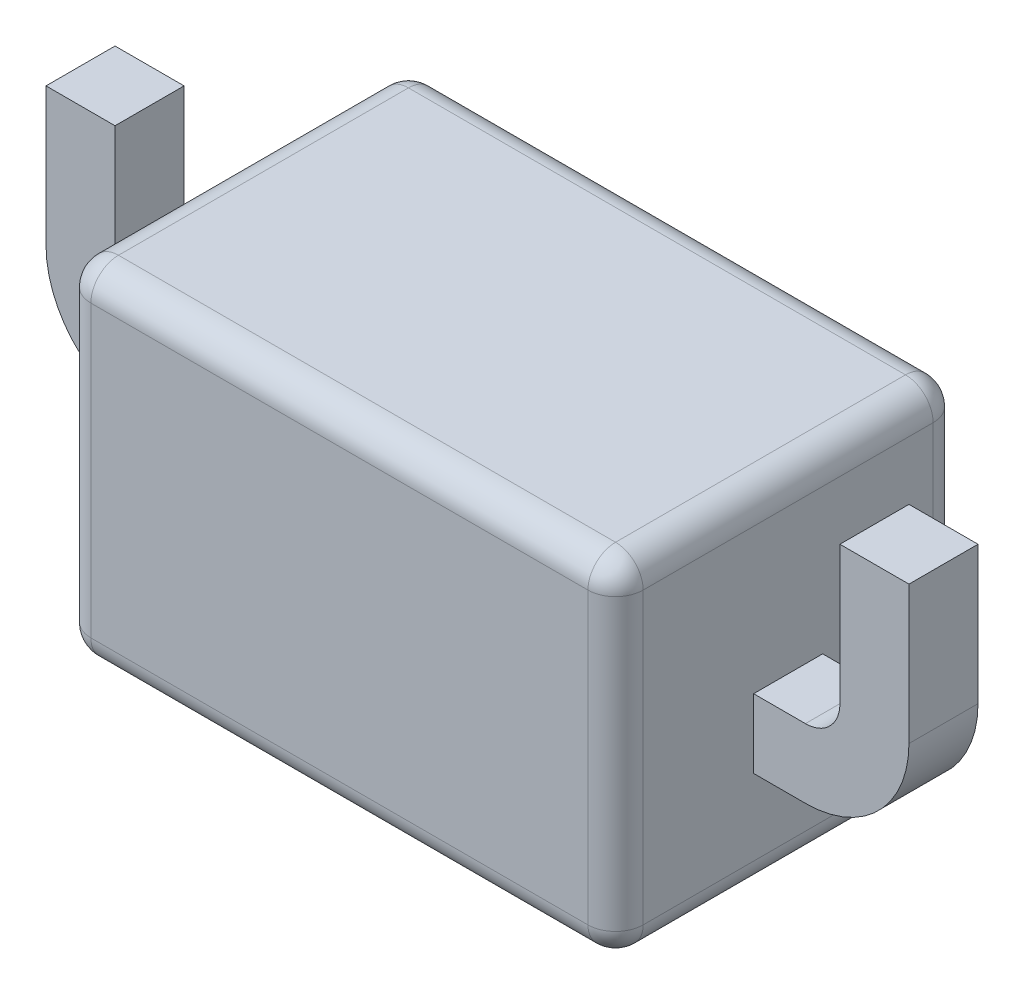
ISO-10303-21;
HEADER;
FILE_DESCRIPTION(('STEP AP214'),'2;1');
FILE_NAME('part.step','',(''),(''),'','','');
FILE_SCHEMA(('AUTOMOTIVE_DESIGN { 1 0 10303 214 1 1 1 1 }'));
ENDSEC;
DATA;
#1=APPLICATION_CONTEXT('core data for automotive mechanical design processes');
#2=APPLICATION_PROTOCOL_DEFINITION('international standard','automotive_design',2000,#1);
#3=PRODUCT_CONTEXT('',#1,'mechanical');
#4=PRODUCT('Part','Part','',(#3));
#5=PRODUCT_RELATED_PRODUCT_CATEGORY('part','',(#4));
#6=PRODUCT_DEFINITION_FORMATION('','',#4);
#7=PRODUCT_DEFINITION_CONTEXT('part definition',#1,'design');
#8=PRODUCT_DEFINITION('design','',#6,#7);
#9=PRODUCT_DEFINITION_SHAPE('','',#8);
#10=(LENGTH_UNIT() NAMED_UNIT(*) SI_UNIT(.MILLI.,.METRE.));
#11=(NAMED_UNIT(*) PLANE_ANGLE_UNIT() SI_UNIT($,.RADIAN.));
#12=(NAMED_UNIT(*) SI_UNIT($,.STERADIAN.) SOLID_ANGLE_UNIT());
#13=UNCERTAINTY_MEASURE_WITH_UNIT(LENGTH_MEASURE(1.E-05),#10,'distance_accuracy_value','');
#14=(GEOMETRIC_REPRESENTATION_CONTEXT(3) GLOBAL_UNCERTAINTY_ASSIGNED_CONTEXT((#13)) GLOBAL_UNIT_ASSIGNED_CONTEXT((#10,
#11,#12)) REPRESENTATION_CONTEXT('',''));
#15=CARTESIAN_POINT('',(0.,0.,0.));
#16=DIRECTION('',(0.,0.,1.));
#17=DIRECTION('',(1.,0.,0.));
#18=AXIS2_PLACEMENT_3D('',#15,#16,#17);
#19=CARTESIAN_POINT('',(1.25,0.,0.1));
#20=DIRECTION('',(0.,0.,1.));
#21=DIRECTION('',(1.,0.,0.));
#22=AXIS2_PLACEMENT_3D('',#19,#20,#21);
#23=PLANE('',#22);
#24=CARTESIAN_POINT('',(0.95,-0.4,0.1));
#25=DIRECTION('',(0.,0.,-1.));
#26=DIRECTION('',(-1.,0.,0.));
#27=AXIS2_PLACEMENT_3D('',#24,#25,#26);
#28=CIRCLE('',#27,0.3);
#29=CARTESIAN_POINT('',(1.25,-0.4,0.1));
#30=VERTEX_POINT('',#29);
#31=CARTESIAN_POINT('',(0.95,-0.7,0.1));
#32=VERTEX_POINT('',#31);
#33=EDGE_CURVE('P0_E21',#30,#32,#28,.T.);
#34=ORIENTED_EDGE('',*,*,#33,.F.);
#35=DIRECTION('',(0.,1.,0.));
#36=VECTOR('',#35,1.);
#37=CARTESIAN_POINT('',(1.25,0.,0.1));
#38=LINE('',#37,#36);
#39=CARTESIAN_POINT('',(1.25,0.,0.1));
#40=VERTEX_POINT('',#39);
#41=EDGE_CURVE('P0_E64',#40,#30,#38,.F.);
#42=ORIENTED_EDGE('',*,*,#41,.F.);
#43=DIRECTION('',(1.,0.,0.));
#44=VECTOR('',#43,1.);
#45=CARTESIAN_POINT('',(1.15,0.,0.1));
#46=LINE('',#45,#44);
#47=CARTESIAN_POINT('',(1.05,0.,0.1));
#48=VERTEX_POINT('',#47);
#49=EDGE_CURVE('P0_E74',#48,#40,#46,.T.);
#50=ORIENTED_EDGE('',*,*,#49,.F.);
#51=DIRECTION('',(0.,1.,0.));
#52=VECTOR('',#51,1.);
#53=CARTESIAN_POINT('',(1.05,0.,0.1));
#54=LINE('',#53,#52);
#55=CARTESIAN_POINT('',(1.05,-0.4,0.1));
#56=VERTEX_POINT('',#55);
#57=EDGE_CURVE('P0_E80',#56,#48,#54,.T.);
#58=ORIENTED_EDGE('',*,*,#57,.F.);
#59=CARTESIAN_POINT('',(0.95,-0.4,0.1));
#60=DIRECTION('',(0.,0.,-1.));
#61=DIRECTION('',(-1.,0.,0.));
#62=AXIS2_PLACEMENT_3D('',#59,#60,#61);
#63=CIRCLE('',#62,0.1);
#64=CARTESIAN_POINT('',(0.95,-0.5,0.1));
#65=VERTEX_POINT('',#64);
#66=EDGE_CURVE('P0_E108',#56,#65,#63,.T.);
#67=ORIENTED_EDGE('',*,*,#66,.T.);
#68=DIRECTION('',(1.,0.,0.));
#69=VECTOR('',#68,1.);
#70=CARTESIAN_POINT('',(0.95,-0.5,0.1));
#71=LINE('',#70,#69);
#72=CARTESIAN_POINT('',(0.8,-0.5,0.1));
#73=VERTEX_POINT('',#72);
#74=EDGE_CURVE('P0_E105',#73,#65,#71,.T.);
#75=ORIENTED_EDGE('',*,*,#74,.F.);
#76=DIRECTION('',(0.,1.,0.));
#77=VECTOR('',#76,1.);
#78=CARTESIAN_POINT('',(0.8,-0.6,0.1));
#79=LINE('',#78,#77);
#80=CARTESIAN_POINT('',(0.8,-0.7,0.1));
#81=VERTEX_POINT('',#80);
#82=EDGE_CURVE('P0_E112',#73,#81,#79,.F.);
#83=ORIENTED_EDGE('',*,*,#82,.T.);
#84=DIRECTION('',(1.,0.,0.));
#85=VECTOR('',#84,1.);
#86=CARTESIAN_POINT('',(0.95,-0.7,0.1));
#87=LINE('',#86,#85);
#88=EDGE_CURVE('P0_E118',#32,#81,#87,.F.);
#89=ORIENTED_EDGE('',*,*,#88,.F.);
#90=EDGE_LOOP('',(#34,#42,#50,#58,#67,#75,#83,#89));
#91=FACE_BOUND('',#90,.T.);
#92=ADVANCED_FACE('P0_F17',(#91),#23,.T.);
#93=CARTESIAN_POINT('',(1.15,0.,0.));
#94=DIRECTION('',(0.,1.,0.));
#95=DIRECTION('',(0.,0.,1.));
#96=AXIS2_PLACEMENT_3D('',#93,#94,#95);
#97=PLANE('',#96);
#98=DIRECTION('',(-1.,0.,0.));
#99=VECTOR('',#98,1.);
#100=CARTESIAN_POINT('',(1.05,0.,-0.1));
#101=LINE('',#100,#99);
#102=CARTESIAN_POINT('',(1.05,0.,-0.1));
#103=VERTEX_POINT('',#102);
#104=CARTESIAN_POINT('',(1.25,0.,-0.1));
#105=VERTEX_POINT('',#104);
#106=EDGE_CURVE('P0_E88',#103,#105,#101,.F.);
#107=ORIENTED_EDGE('',*,*,#106,.F.);
#108=DIRECTION('',(0.,0.,1.));
#109=VECTOR('',#108,1.);
#110=CARTESIAN_POINT('',(1.05,0.,0.1));
#111=LINE('',#110,#109);
#112=EDGE_CURVE('P0_E85',#48,#103,#111,.F.);
#113=ORIENTED_EDGE('',*,*,#112,.F.);
#114=ORIENTED_EDGE('',*,*,#49,.T.);
#115=DIRECTION('',(0.,0.,-1.));
#116=VECTOR('',#115,1.);
#117=CARTESIAN_POINT('',(1.25,0.,-0.1));
#118=LINE('',#117,#116);
#119=EDGE_CURVE('P0_E81',#105,#40,#118,.F.);
#120=ORIENTED_EDGE('',*,*,#119,.F.);
#121=EDGE_LOOP('',(#107,#113,#114,#120));
#122=FACE_BOUND('',#121,.T.);
#123=ADVANCED_FACE('P0_F86',(#122),#97,.T.);
#124=CARTESIAN_POINT('',(1.25,0.,-0.1));
#125=DIRECTION('',(1.,0.,0.));
#126=DIRECTION('',(0.,0.,-1.));
#127=AXIS2_PLACEMENT_3D('',#124,#125,#126);
#128=PLANE('',#127);
#129=DIRECTION('',(0.,0.,-1.));
#130=VECTOR('',#129,1.);
#131=CARTESIAN_POINT('',(1.25,-0.4,0.));
#132=LINE('',#131,#130);
#133=CARTESIAN_POINT('',(1.25,-0.4,-0.1));
#134=VERTEX_POINT('',#133);
#135=EDGE_CURVE('P0_E125',#134,#30,#132,.F.);
#136=ORIENTED_EDGE('',*,*,#135,.F.);
#137=DIRECTION('',(0.,1.,0.));
#138=VECTOR('',#137,1.);
#139=CARTESIAN_POINT('',(1.25,0.,-0.1));
#140=LINE('',#139,#138);
#141=EDGE_CURVE('P0_E94',#105,#134,#140,.F.);
#142=ORIENTED_EDGE('',*,*,#141,.F.);
#143=ORIENTED_EDGE('',*,*,#119,.T.);
#144=ORIENTED_EDGE('',*,*,#41,.T.);
#145=EDGE_LOOP('',(#136,#142,#143,#144));
#146=FACE_BOUND('',#145,.T.);
#147=ADVANCED_FACE('P0_F159',(#146),#128,.T.);
#148=CARTESIAN_POINT('',(0.95,-0.4,0.));
#149=DIRECTION('',(0.,0.,-1.));
#150=DIRECTION('',(-1.,0.,0.));
#151=AXIS2_PLACEMENT_3D('',#148,#149,#150);
#152=CYLINDRICAL_SURFACE('',#151,0.3);
#153=DIRECTION('',(0.,0.,-1.));
#154=VECTOR('',#153,1.);
#155=CARTESIAN_POINT('',(0.95,-0.7,-0.1));
#156=LINE('',#155,#154);
#157=CARTESIAN_POINT('',(0.95,-0.7,-0.1));
#158=VERTEX_POINT('',#157);
#159=EDGE_CURVE('P0_E121',#158,#32,#156,.F.);
#160=ORIENTED_EDGE('',*,*,#159,.F.);
#161=CARTESIAN_POINT('',(0.95,-0.4,-0.1));
#162=DIRECTION('',(0.,0.,-1.));
#163=DIRECTION('',(-1.,0.,0.));
#164=AXIS2_PLACEMENT_3D('',#161,#162,#163);
#165=CIRCLE('',#164,0.3);
#166=EDGE_CURVE('P0_E131',#134,#158,#165,.T.);
#167=ORIENTED_EDGE('',*,*,#166,.F.);
#168=ORIENTED_EDGE('',*,*,#135,.T.);
#169=ORIENTED_EDGE('',*,*,#33,.T.);
#170=EDGE_LOOP('',(#160,#167,#168,#169));
#171=FACE_BOUND('',#170,.T.);
#172=ADVANCED_FACE('P0_F231',(#171),#152,.T.);
#173=CARTESIAN_POINT('',(0.95,-0.7,-0.1));
#174=DIRECTION('',(0.,-1.,0.));
#175=DIRECTION('',(0.,0.,-1.));
#176=AXIS2_PLACEMENT_3D('',#173,#174,#175);
#177=PLANE('',#176);
#178=DIRECTION('',(0.,0.,1.));
#179=VECTOR('',#178,1.);
#180=CARTESIAN_POINT('',(0.8,-0.7,0.));
#181=LINE('',#180,#179);
#182=CARTESIAN_POINT('',(0.8,-0.7,-0.1));
#183=VERTEX_POINT('',#182);
#184=EDGE_CURVE('P0_E115',#81,#183,#181,.F.);
#185=ORIENTED_EDGE('',*,*,#184,.T.);
#186=DIRECTION('',(-1.,0.,0.));
#187=VECTOR('',#186,1.);
#188=CARTESIAN_POINT('',(1.05,-0.7,-0.1));
#189=LINE('',#188,#187);
#190=EDGE_CURVE('P0_E133',#158,#183,#189,.T.);
#191=ORIENTED_EDGE('',*,*,#190,.F.);
#192=ORIENTED_EDGE('',*,*,#159,.T.);
#193=ORIENTED_EDGE('',*,*,#88,.T.);
#194=EDGE_LOOP('',(#185,#191,#192,#193));
#195=FACE_BOUND('',#194,.T.);
#196=ADVANCED_FACE('P0_F169',(#195),#177,.T.);
#197=CARTESIAN_POINT('',(0.8,-0.6,0.));
#198=DIRECTION('',(1.,0.,0.));
#199=DIRECTION('',(0.,1.,0.));
#200=AXIS2_PLACEMENT_3D('',#197,#198,#199);
#201=PLANE('',#200);
#202=DIRECTION('',(0.,0.,1.));
#203=VECTOR('',#202,1.);
#204=CARTESIAN_POINT('',(0.8,-0.5,0.1));
#205=LINE('',#204,#203);
#206=CARTESIAN_POINT('',(0.8,-0.5,-0.1));
#207=VERTEX_POINT('',#206);
#208=EDGE_CURVE('P0_E109',#207,#73,#205,.T.);
#209=ORIENTED_EDGE('',*,*,#208,.F.);
#210=DIRECTION('',(0.,1.,0.));
#211=VECTOR('',#210,1.);
#212=CARTESIAN_POINT('',(0.8,0.,-0.1));
#213=LINE('',#212,#211);
#214=EDGE_CURVE('P0_E146',#183,#207,#213,.T.);
#215=ORIENTED_EDGE('',*,*,#214,.F.);
#216=ORIENTED_EDGE('',*,*,#184,.F.);
#217=ORIENTED_EDGE('',*,*,#82,.F.);
#218=EDGE_LOOP('',(#209,#215,#216,#217));
#219=FACE_BOUND('',#218,.T.);
#220=ADVANCED_FACE('P0_F174',(#219),#201,.F.);
#221=CARTESIAN_POINT('',(0.95,-0.5,0.1));
#222=DIRECTION('',(0.,1.,0.));
#223=DIRECTION('',(0.,0.,1.));
#224=AXIS2_PLACEMENT_3D('',#221,#222,#223);
#225=PLANE('',#224);
#226=ORIENTED_EDGE('',*,*,#208,.T.);
#227=ORIENTED_EDGE('',*,*,#74,.T.);
#228=DIRECTION('',(0.,0.,-1.));
#229=VECTOR('',#228,1.);
#230=CARTESIAN_POINT('',(0.95,-0.5,0.));
#231=LINE('',#230,#229);
#232=CARTESIAN_POINT('',(0.95,-0.5,-0.1));
#233=VERTEX_POINT('',#232);
#234=EDGE_CURVE('P0_E90',#65,#233,#231,.T.);
#235=ORIENTED_EDGE('',*,*,#234,.T.);
#236=DIRECTION('',(-1.,0.,0.));
#237=VECTOR('',#236,1.);
#238=CARTESIAN_POINT('',(1.05,-0.5,-0.1));
#239=LINE('',#238,#237);
#240=EDGE_CURVE('P0_E130',#207,#233,#239,.F.);
#241=ORIENTED_EDGE('',*,*,#240,.F.);
#242=EDGE_LOOP('',(#226,#227,#235,#241));
#243=FACE_BOUND('',#242,.T.);
#244=ADVANCED_FACE('P0_F192',(#243),#225,.T.);
#245=CARTESIAN_POINT('',(0.95,-0.4,0.));
#246=DIRECTION('',(0.,0.,-1.));
#247=DIRECTION('',(-1.,0.,0.));
#248=AXIS2_PLACEMENT_3D('',#245,#246,#247);
#249=CYLINDRICAL_SURFACE('',#248,0.1);
#250=CARTESIAN_POINT('',(0.95,-0.4,-0.1));
#251=DIRECTION('',(0.,0.,-1.));
#252=DIRECTION('',(-1.,0.,0.));
#253=AXIS2_PLACEMENT_3D('',#250,#251,#252);
#254=CIRCLE('',#253,0.1);
#255=CARTESIAN_POINT('',(1.05,-0.4,-0.1));
#256=VERTEX_POINT('',#255);
#257=EDGE_CURVE('P0_E27',#233,#256,#254,.F.);
#258=ORIENTED_EDGE('',*,*,#257,.F.);
#259=ORIENTED_EDGE('',*,*,#234,.F.);
#260=ORIENTED_EDGE('',*,*,#66,.F.);
#261=DIRECTION('',(0.,0.,1.));
#262=VECTOR('',#261,1.);
#263=CARTESIAN_POINT('',(1.05,-0.4,0.1));
#264=LINE('',#263,#262);
#265=EDGE_CURVE('P0_E36',#256,#56,#264,.T.);
#266=ORIENTED_EDGE('',*,*,#265,.F.);
#267=EDGE_LOOP('',(#258,#259,#260,#266));
#268=FACE_BOUND('',#267,.T.);
#269=ADVANCED_FACE('P0_F190',(#268),#249,.F.);
#270=CARTESIAN_POINT('',(1.05,0.,0.1));
#271=DIRECTION('',(-1.,0.,0.));
#272=DIRECTION('',(0.,0.,1.));
#273=AXIS2_PLACEMENT_3D('',#270,#271,#272);
#274=PLANE('',#273);
#275=ORIENTED_EDGE('',*,*,#265,.T.);
#276=ORIENTED_EDGE('',*,*,#57,.T.);
#277=ORIENTED_EDGE('',*,*,#112,.T.);
#278=DIRECTION('',(0.,1.,0.));
#279=VECTOR('',#278,1.);
#280=CARTESIAN_POINT('',(1.05,0.,-0.1));
#281=LINE('',#280,#279);
#282=EDGE_CURVE('P0_E11',#256,#103,#281,.T.);
#283=ORIENTED_EDGE('',*,*,#282,.F.);
#284=EDGE_LOOP('',(#275,#276,#277,#283));
#285=FACE_BOUND('',#284,.T.);
#286=ADVANCED_FACE('P0_F92',(#285),#274,.T.);
#287=CARTESIAN_POINT('',(1.05,0.,-0.1));
#288=DIRECTION('',(0.,0.,-1.));
#289=DIRECTION('',(-1.,0.,0.));
#290=AXIS2_PLACEMENT_3D('',#287,#288,#289);
#291=PLANE('',#290);
#292=ORIENTED_EDGE('',*,*,#257,.T.);
#293=ORIENTED_EDGE('',*,*,#282,.T.);
#294=ORIENTED_EDGE('',*,*,#106,.T.);
#295=ORIENTED_EDGE('',*,*,#141,.T.);
#296=ORIENTED_EDGE('',*,*,#166,.T.);
#297=ORIENTED_EDGE('',*,*,#190,.T.);
#298=ORIENTED_EDGE('',*,*,#214,.T.);
#299=ORIENTED_EDGE('',*,*,#240,.T.);
#300=EDGE_LOOP('',(#292,#293,#294,#295,#296,#297,#298,#299));
#301=FACE_BOUND('',#300,.T.);
#302=ADVANCED_FACE('P0_F19',(#301),#291,.T.);
#303=CLOSED_SHELL('',(#92,#123,#147,#172,#196,#220,#244,#269,#286,#302));
#304=MANIFOLD_SOLID_BREP('P0_B1',#303);
#305=CARTESIAN_POINT('',(-1.25,0.,0.1));
#306=DIRECTION('',(0.,0.,-1.));
#307=DIRECTION('',(-1.,0.,0.));
#308=AXIS2_PLACEMENT_3D('',#305,#306,#307);
#309=PLANE('',#308);
#310=DIRECTION('',(0.,1.,0.));
#311=VECTOR('',#310,1.);
#312=CARTESIAN_POINT('',(-1.25,0.,0.1));
#313=LINE('',#312,#311);
#314=CARTESIAN_POINT('',(-1.25,0.,0.1));
#315=VERTEX_POINT('',#314);
#316=CARTESIAN_POINT('',(-1.25,-0.4,0.1));
#317=VERTEX_POINT('',#316);
#318=EDGE_CURVE('P1_E85',#315,#317,#313,.F.);
#319=ORIENTED_EDGE('',*,*,#318,.T.);
#320=CARTESIAN_POINT('',(-0.95,-0.4,0.1));
#321=DIRECTION('',(0.,0.,1.));
#322=DIRECTION('',(1.,0.,0.));
#323=AXIS2_PLACEMENT_3D('',#320,#321,#322);
#324=CIRCLE('',#323,0.3);
#325=CARTESIAN_POINT('',(-0.95,-0.7,0.1));
#326=VERTEX_POINT('',#325);
#327=EDGE_CURVE('P1_E21',#326,#317,#324,.F.);
#328=ORIENTED_EDGE('',*,*,#327,.F.);
#329=DIRECTION('',(1.,0.,0.));
#330=VECTOR('',#329,1.);
#331=CARTESIAN_POINT('',(-0.95,-0.7,0.1));
#332=LINE('',#331,#330);
#333=CARTESIAN_POINT('',(-0.8,-0.7,0.1));
#334=VERTEX_POINT('',#333);
#335=EDGE_CURVE('P1_E80',#326,#334,#332,.T.);
#336=ORIENTED_EDGE('',*,*,#335,.T.);
#337=DIRECTION('',(0.,1.,0.));
#338=VECTOR('',#337,1.);
#339=CARTESIAN_POINT('',(-0.8,-0.6,0.1));
#340=LINE('',#339,#338);
#341=CARTESIAN_POINT('',(-0.8,-0.5,0.1));
#342=VERTEX_POINT('',#341);
#343=EDGE_CURVE('P1_E127',#342,#334,#340,.F.);
#344=ORIENTED_EDGE('',*,*,#343,.F.);
#345=DIRECTION('',(1.,0.,0.));
#346=VECTOR('',#345,1.);
#347=CARTESIAN_POINT('',(-0.95,-0.5,0.1));
#348=LINE('',#347,#346);
#349=CARTESIAN_POINT('',(-0.95,-0.5,0.1));
#350=VERTEX_POINT('',#349);
#351=EDGE_CURVE('P1_E121',#342,#350,#348,.F.);
#352=ORIENTED_EDGE('',*,*,#351,.T.);
#353=CARTESIAN_POINT('',(-0.95,-0.4,0.1));
#354=DIRECTION('',(0.,0.,1.));
#355=DIRECTION('',(1.,0.,0.));
#356=AXIS2_PLACEMENT_3D('',#353,#354,#355);
#357=CIRCLE('',#356,0.1);
#358=CARTESIAN_POINT('',(-1.05,-0.4,0.1));
#359=VERTEX_POINT('',#358);
#360=EDGE_CURVE('P1_E141',#350,#359,#357,.F.);
#361=ORIENTED_EDGE('',*,*,#360,.T.);
#362=DIRECTION('',(0.,1.,0.));
#363=VECTOR('',#362,1.);
#364=CARTESIAN_POINT('',(-1.05,0.,0.1));
#365=LINE('',#364,#363);
#366=CARTESIAN_POINT('',(-1.05,0.,0.1));
#367=VERTEX_POINT('',#366);
#368=EDGE_CURVE('P1_E109',#359,#367,#365,.T.);
#369=ORIENTED_EDGE('',*,*,#368,.T.);
#370=DIRECTION('',(1.,0.,0.));
#371=VECTOR('',#370,1.);
#372=CARTESIAN_POINT('',(-1.15,0.,0.1));
#373=LINE('',#372,#371);
#374=EDGE_CURVE('P1_E88',#367,#315,#373,.F.);
#375=ORIENTED_EDGE('',*,*,#374,.T.);
#376=EDGE_LOOP('',(#319,#328,#336,#344,#352,#361,#369,#375));
#377=FACE_BOUND('',#376,.T.);
#378=ADVANCED_FACE('P1_F17',(#377),#309,.F.);
#379=CARTESIAN_POINT('',(-1.25,0.,-0.1));
#380=DIRECTION('',(1.,0.,0.));
#381=DIRECTION('',(0.,0.,-1.));
#382=AXIS2_PLACEMENT_3D('',#379,#380,#381);
#383=PLANE('',#382);
#384=DIRECTION('',(0.,1.,0.));
#385=VECTOR('',#384,1.);
#386=CARTESIAN_POINT('',(-1.25,0.,-0.1));
#387=LINE('',#386,#385);
#388=CARTESIAN_POINT('',(-1.25,0.,-0.1));
#389=VERTEX_POINT('',#388);
#390=CARTESIAN_POINT('',(-1.25,-0.4,-0.1));
#391=VERTEX_POINT('',#390);
#392=EDGE_CURVE('P1_E102',#389,#391,#387,.F.);
#393=ORIENTED_EDGE('',*,*,#392,.T.);
#394=DIRECTION('',(0.,0.,1.));
#395=VECTOR('',#394,1.);
#396=CARTESIAN_POINT('',(-1.25,-0.4,0.));
#397=LINE('',#396,#395);
#398=EDGE_CURVE('P1_E93',#317,#391,#397,.F.);
#399=ORIENTED_EDGE('',*,*,#398,.F.);
#400=ORIENTED_EDGE('',*,*,#318,.F.);
#401=DIRECTION('',(0.,0.,-1.));
#402=VECTOR('',#401,1.);
#403=CARTESIAN_POINT('',(-1.25,0.,0.));
#404=LINE('',#403,#402);
#405=EDGE_CURVE('P1_E107',#315,#389,#404,.T.);
#406=ORIENTED_EDGE('',*,*,#405,.T.);
#407=EDGE_LOOP('',(#393,#399,#400,#406));
#408=FACE_BOUND('',#407,.T.);
#409=ADVANCED_FACE('P1_F101',(#408),#383,.F.);
#410=CARTESIAN_POINT('',(-0.95,-0.4,0.));
#411=DIRECTION('',(0.,0.,1.));
#412=DIRECTION('',(1.,0.,0.));
#413=AXIS2_PLACEMENT_3D('',#410,#411,#412);
#414=CYLINDRICAL_SURFACE('',#413,0.3);
#415=DIRECTION('',(0.,0.,1.));
#416=VECTOR('',#415,1.);
#417=CARTESIAN_POINT('',(-0.95,-0.7,-0.1));
#418=LINE('',#417,#416);
#419=CARTESIAN_POINT('',(-0.95,-0.7,-0.1));
#420=VERTEX_POINT('',#419);
#421=EDGE_CURVE('P1_E99',#420,#326,#418,.T.);
#422=ORIENTED_EDGE('',*,*,#421,.T.);
#423=ORIENTED_EDGE('',*,*,#327,.T.);
#424=ORIENTED_EDGE('',*,*,#398,.T.);
#425=CARTESIAN_POINT('',(-0.95,-0.4,-0.1));
#426=DIRECTION('',(0.,0.,1.));
#427=DIRECTION('',(1.,0.,0.));
#428=AXIS2_PLACEMENT_3D('',#425,#426,#427);
#429=CIRCLE('',#428,0.3);
#430=EDGE_CURVE('P1_E139',#391,#420,#429,.T.);
#431=ORIENTED_EDGE('',*,*,#430,.T.);
#432=EDGE_LOOP('',(#422,#423,#424,#431));
#433=FACE_BOUND('',#432,.T.);
#434=ADVANCED_FACE('P1_F96',(#433),#414,.T.);
#435=CARTESIAN_POINT('',(-0.95,-0.7,-0.1));
#436=DIRECTION('',(0.,1.,0.));
#437=DIRECTION('',(0.,0.,1.));
#438=AXIS2_PLACEMENT_3D('',#435,#436,#437);
#439=PLANE('',#438);
#440=DIRECTION('',(1.,0.,0.));
#441=VECTOR('',#440,1.);
#442=CARTESIAN_POINT('',(-1.05,-0.7,-0.1));
#443=LINE('',#442,#441);
#444=CARTESIAN_POINT('',(-0.8,-0.7,-0.1));
#445=VERTEX_POINT('',#444);
#446=EDGE_CURVE('P1_E140',#420,#445,#443,.T.);
#447=ORIENTED_EDGE('',*,*,#446,.T.);
#448=DIRECTION('',(0.,0.,1.));
#449=VECTOR('',#448,1.);
#450=CARTESIAN_POINT('',(-0.8,-0.7,0.));
#451=LINE('',#450,#449);
#452=EDGE_CURVE('P1_E129',#334,#445,#451,.F.);
#453=ORIENTED_EDGE('',*,*,#452,.F.);
#454=ORIENTED_EDGE('',*,*,#335,.F.);
#455=ORIENTED_EDGE('',*,*,#421,.F.);
#456=EDGE_LOOP('',(#447,#453,#454,#455));
#457=FACE_BOUND('',#456,.T.);
#458=ADVANCED_FACE('P1_F174',(#457),#439,.F.);
#459=CARTESIAN_POINT('',(-0.8,-0.6,0.));
#460=DIRECTION('',(1.,0.,0.));
#461=DIRECTION('',(0.,1.,0.));
#462=AXIS2_PLACEMENT_3D('',#459,#460,#461);
#463=PLANE('',#462);
#464=DIRECTION('',(0.,1.,0.));
#465=VECTOR('',#464,1.);
#466=CARTESIAN_POINT('',(-0.8,0.,-0.1));
#467=LINE('',#466,#465);
#468=CARTESIAN_POINT('',(-0.8,-0.5,-0.1));
#469=VERTEX_POINT('',#468);
#470=EDGE_CURVE('P1_E159',#445,#469,#467,.T.);
#471=ORIENTED_EDGE('',*,*,#470,.T.);
#472=DIRECTION('',(0.,0.,-1.));
#473=VECTOR('',#472,1.);
#474=CARTESIAN_POINT('',(-0.8,-0.5,0.1));
#475=LINE('',#474,#473);
#476=EDGE_CURVE('P1_E124',#469,#342,#475,.F.);
#477=ORIENTED_EDGE('',*,*,#476,.T.);
#478=ORIENTED_EDGE('',*,*,#343,.T.);
#479=ORIENTED_EDGE('',*,*,#452,.T.);
#480=EDGE_LOOP('',(#471,#477,#478,#479));
#481=FACE_BOUND('',#480,.T.);
#482=ADVANCED_FACE('P1_F167',(#481),#463,.T.);
#483=CARTESIAN_POINT('',(-0.95,-0.5,0.1));
#484=DIRECTION('',(0.,-1.,0.));
#485=DIRECTION('',(0.,0.,-1.));
#486=AXIS2_PLACEMENT_3D('',#483,#484,#485);
#487=PLANE('',#486);
#488=ORIENTED_EDGE('',*,*,#351,.F.);
#489=ORIENTED_EDGE('',*,*,#476,.F.);
#490=DIRECTION('',(1.,0.,0.));
#491=VECTOR('',#490,1.);
#492=CARTESIAN_POINT('',(-1.05,-0.5,-0.1));
#493=LINE('',#492,#491);
#494=CARTESIAN_POINT('',(-0.95,-0.5,-0.1));
#495=VERTEX_POINT('',#494);
#496=EDGE_CURVE('P1_E138',#469,#495,#493,.F.);
#497=ORIENTED_EDGE('',*,*,#496,.T.);
#498=DIRECTION('',(0.,0.,1.));
#499=VECTOR('',#498,1.);
#500=CARTESIAN_POINT('',(-0.95,-0.5,0.));
#501=LINE('',#500,#499);
#502=EDGE_CURVE('P1_E123',#495,#350,#501,.T.);
#503=ORIENTED_EDGE('',*,*,#502,.T.);
#504=EDGE_LOOP('',(#488,#489,#497,#503));
#505=FACE_BOUND('',#504,.T.);
#506=ADVANCED_FACE('P1_F192',(#505),#487,.F.);
#507=CARTESIAN_POINT('',(-0.95,-0.4,0.));
#508=DIRECTION('',(0.,0.,1.));
#509=DIRECTION('',(1.,0.,0.));
#510=AXIS2_PLACEMENT_3D('',#507,#508,#509);
#511=CYLINDRICAL_SURFACE('',#510,0.1);
#512=ORIENTED_EDGE('',*,*,#360,.F.);
#513=ORIENTED_EDGE('',*,*,#502,.F.);
#514=CARTESIAN_POINT('',(-0.95,-0.4,-0.1));
#515=DIRECTION('',(0.,0.,1.));
#516=DIRECTION('',(1.,0.,0.));
#517=AXIS2_PLACEMENT_3D('',#514,#515,#516);
#518=CIRCLE('',#517,0.1);
#519=CARTESIAN_POINT('',(-1.05,-0.4,-0.1));
#520=VERTEX_POINT('',#519);
#521=EDGE_CURVE('P1_E135',#495,#520,#518,.F.);
#522=ORIENTED_EDGE('',*,*,#521,.T.);
#523=DIRECTION('',(0.,0.,1.));
#524=VECTOR('',#523,1.);
#525=CARTESIAN_POINT('',(-1.05,-0.4,0.1));
#526=LINE('',#525,#524);
#527=EDGE_CURVE('P1_E113',#520,#359,#526,.T.);
#528=ORIENTED_EDGE('',*,*,#527,.T.);
#529=EDGE_LOOP('',(#512,#513,#522,#528));
#530=FACE_BOUND('',#529,.T.);
#531=ADVANCED_FACE('P1_F194',(#530),#511,.F.);
#532=CARTESIAN_POINT('',(-1.05,0.,0.1));
#533=DIRECTION('',(-1.,0.,0.));
#534=DIRECTION('',(0.,0.,1.));
#535=AXIS2_PLACEMENT_3D('',#532,#533,#534);
#536=PLANE('',#535);
#537=ORIENTED_EDGE('',*,*,#368,.F.);
#538=ORIENTED_EDGE('',*,*,#527,.F.);
#539=DIRECTION('',(0.,1.,0.));
#540=VECTOR('',#539,1.);
#541=CARTESIAN_POINT('',(-1.05,0.,-0.1));
#542=LINE('',#541,#540);
#543=CARTESIAN_POINT('',(-1.05,0.,-0.1));
#544=VERTEX_POINT('',#543);
#545=EDGE_CURVE('P1_E27',#520,#544,#542,.T.);
#546=ORIENTED_EDGE('',*,*,#545,.T.);
#547=DIRECTION('',(0.,0.,-1.));
#548=VECTOR('',#547,1.);
#549=CARTESIAN_POINT('',(-1.05,0.,0.));
#550=LINE('',#549,#548);
#551=EDGE_CURVE('P1_E35',#544,#367,#550,.F.);
#552=ORIENTED_EDGE('',*,*,#551,.T.);
#553=EDGE_LOOP('',(#537,#538,#546,#552));
#554=FACE_BOUND('',#553,.T.);
#555=ADVANCED_FACE('P1_F188',(#554),#536,.F.);
#556=CARTESIAN_POINT('',(-1.15,0.,0.));
#557=DIRECTION('',(0.,-1.,0.));
#558=DIRECTION('',(0.,0.,-1.));
#559=AXIS2_PLACEMENT_3D('',#556,#557,#558);
#560=PLANE('',#559);
#561=ORIENTED_EDGE('',*,*,#551,.F.);
#562=DIRECTION('',(1.,0.,0.));
#563=VECTOR('',#562,1.);
#564=CARTESIAN_POINT('',(-1.05,0.,-0.1));
#565=LINE('',#564,#563);
#566=EDGE_CURVE('P1_E11',#544,#389,#565,.F.);
#567=ORIENTED_EDGE('',*,*,#566,.T.);
#568=ORIENTED_EDGE('',*,*,#405,.F.);
#569=ORIENTED_EDGE('',*,*,#374,.F.);
#570=EDGE_LOOP('',(#561,#567,#568,#569));
#571=FACE_BOUND('',#570,.T.);
#572=ADVANCED_FACE('P1_F202',(#571),#560,.F.);
#573=CARTESIAN_POINT('',(-1.05,0.,-0.1));
#574=DIRECTION('',(0.,0.,1.));
#575=DIRECTION('',(1.,0.,0.));
#576=AXIS2_PLACEMENT_3D('',#573,#574,#575);
#577=PLANE('',#576);
#578=ORIENTED_EDGE('',*,*,#545,.F.);
#579=ORIENTED_EDGE('',*,*,#521,.F.);
#580=ORIENTED_EDGE('',*,*,#496,.F.);
#581=ORIENTED_EDGE('',*,*,#470,.F.);
#582=ORIENTED_EDGE('',*,*,#446,.F.);
#583=ORIENTED_EDGE('',*,*,#430,.F.);
#584=ORIENTED_EDGE('',*,*,#392,.F.);
#585=ORIENTED_EDGE('',*,*,#566,.F.);
#586=EDGE_LOOP('',(#578,#579,#580,#581,#582,#583,#584,#585));
#587=FACE_BOUND('',#586,.T.);
#588=ADVANCED_FACE('P1_F19',(#587),#577,.F.);
#589=CLOSED_SHELL('',(#378,#409,#434,#458,#482,#506,#531,#555,#572,#588));
#590=MANIFOLD_SOLID_BREP('P1_B1',#589);
#591=CARTESIAN_POINT('',(-0.72,-0.08,-0.42));
#592=DIRECTION('',(-0.577350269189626,0.577350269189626,-0.577350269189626));
#593=DIRECTION('',(0.707106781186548,0.,-0.707106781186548));
#594=AXIS2_PLACEMENT_3D('',#591,#592,#593);
#595=SPHERICAL_SURFACE('',#594,0.08);
#596=CARTESIAN_POINT('',(-0.76618802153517,-0.03381197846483,-0.46618802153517));
#597=VERTEX_POINT('',#596);
#598=VERTEX_LOOP('',#597);
#599=FACE_BOUND('',#598,.T.);
#600=CARTESIAN_POINT('',(-0.72,-0.08,-0.42));
#601=DIRECTION('',(1.,0.,0.));
#602=DIRECTION('',(0.,0.,-1.));
#603=AXIS2_PLACEMENT_3D('',#600,#601,#602);
#604=CIRCLE('',#603,0.08);
#605=CARTESIAN_POINT('',(-0.72,-0.08,-0.5));
#606=VERTEX_POINT('',#605);
#607=CARTESIAN_POINT('',(-0.72,0.,-0.42));
#608=VERTEX_POINT('',#607);
#609=EDGE_CURVE('P2_E225',#606,#608,#604,.T.);
#610=ORIENTED_EDGE('',*,*,#609,.F.);
#611=CARTESIAN_POINT('',(-0.72,-0.08,-0.42));
#612=DIRECTION('',(0.,-1.,0.));
#613=DIRECTION('',(0.,0.,-1.));
#614=AXIS2_PLACEMENT_3D('',#611,#612,#613);
#615=CIRCLE('',#614,0.08);
#616=CARTESIAN_POINT('',(-0.8,-0.08,-0.42));
#617=VERTEX_POINT('',#616);
#618=EDGE_CURVE('P2_E221',#617,#606,#615,.T.);
#619=ORIENTED_EDGE('',*,*,#618,.F.);
#620=CARTESIAN_POINT('',(-0.72,-0.08,-0.42));
#621=DIRECTION('',(0.,0.,-1.));
#622=DIRECTION('',(-1.,0.,0.));
#623=AXIS2_PLACEMENT_3D('',#620,#621,#622);
#624=CIRCLE('',#623,0.08);
#625=EDGE_CURVE('P2_E21',#608,#617,#624,.F.);
#626=ORIENTED_EDGE('',*,*,#625,.F.);
#627=EDGE_LOOP('',(#610,#619,#626));
#628=FACE_BOUND('',#627,.T.);
#629=ADVANCED_FACE('P2_F17',(#599,#628),#595,.T.);
#630=CARTESIAN_POINT('',(0.72,-0.08,-0.42));
#631=DIRECTION('',(0.577350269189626,0.577350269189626,-0.577350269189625));
#632=DIRECTION('',(0.707106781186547,-0.707106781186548,0.));
#633=AXIS2_PLACEMENT_3D('',#630,#631,#632);
#634=SPHERICAL_SURFACE('',#633,0.08);
#635=CARTESIAN_POINT('',(0.76618802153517,-0.0338119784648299,-0.46618802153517));
#636=VERTEX_POINT('',#635);
#637=VERTEX_LOOP('',#636);
#638=FACE_BOUND('',#637,.T.);
#639=CARTESIAN_POINT('',(0.72,-0.08,-0.42));
#640=DIRECTION('',(1.,0.,0.));
#641=DIRECTION('',(0.,0.,-1.));
#642=AXIS2_PLACEMENT_3D('',#639,#640,#641);
#643=CIRCLE('',#642,0.08);
#644=CARTESIAN_POINT('',(0.72,0.,-0.42));
#645=VERTEX_POINT('',#644);
#646=CARTESIAN_POINT('',(0.72,-0.08,-0.5));
#647=VERTEX_POINT('',#646);
#648=EDGE_CURVE('P2_E227',#645,#647,#643,.F.);
#649=ORIENTED_EDGE('',*,*,#648,.F.);
#650=CARTESIAN_POINT('',(0.72,-0.08,-0.42));
#651=DIRECTION('',(0.,0.,1.));
#652=DIRECTION('',(1.,0.,0.));
#653=AXIS2_PLACEMENT_3D('',#650,#651,#652);
#654=CIRCLE('',#653,0.08);
#655=CARTESIAN_POINT('',(0.8,-0.08,-0.42));
#656=VERTEX_POINT('',#655);
#657=EDGE_CURVE('P2_E212',#656,#645,#654,.T.);
#658=ORIENTED_EDGE('',*,*,#657,.F.);
#659=CARTESIAN_POINT('',(0.72,-0.08,-0.42));
#660=DIRECTION('',(0.,-1.,0.));
#661=DIRECTION('',(0.,0.,-1.));
#662=AXIS2_PLACEMENT_3D('',#659,#660,#661);
#663=CIRCLE('',#662,0.08);
#664=EDGE_CURVE('P2_E218',#647,#656,#663,.T.);
#665=ORIENTED_EDGE('',*,*,#664,.F.);
#666=EDGE_LOOP('',(#649,#658,#665));
#667=FACE_BOUND('',#666,.T.);
#668=ADVANCED_FACE('P2_F269',(#638,#667),#634,.T.);
#669=CARTESIAN_POINT('',(-0.72,-0.08,0.42));
#670=DIRECTION('',(-0.577350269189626,0.577350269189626,0.577350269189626));
#671=DIRECTION('',(0.707106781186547,0.707106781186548,0.));
#672=AXIS2_PLACEMENT_3D('',#669,#670,#671);
#673=SPHERICAL_SURFACE('',#672,0.0800000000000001);
#674=CARTESIAN_POINT('',(-0.76618802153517,-0.0338119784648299,0.46618802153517));
#675=VERTEX_POINT('',#674);
#676=VERTEX_LOOP('',#675);
#677=FACE_BOUND('',#676,.T.);
#678=CARTESIAN_POINT('',(-0.72,-0.08,0.42));
#679=DIRECTION('',(0.,0.,-1.));
#680=DIRECTION('',(-1.,0.,0.));
#681=AXIS2_PLACEMENT_3D('',#678,#679,#680);
#682=CIRCLE('',#681,0.08);
#683=CARTESIAN_POINT('',(-0.8,-0.08,0.42));
#684=VERTEX_POINT('',#683);
#685=CARTESIAN_POINT('',(-0.72,0.,0.42));
#686=VERTEX_POINT('',#685);
#687=EDGE_CURVE('P2_E229',#684,#686,#682,.T.);
#688=ORIENTED_EDGE('',*,*,#687,.F.);
#689=CARTESIAN_POINT('',(-0.72,-0.08,0.42));
#690=DIRECTION('',(0.,-1.,0.));
#691=DIRECTION('',(0.,0.,-1.));
#692=AXIS2_PLACEMENT_3D('',#689,#690,#691);
#693=CIRCLE('',#692,0.08);
#694=CARTESIAN_POINT('',(-0.72,-0.08,0.5));
#695=VERTEX_POINT('',#694);
#696=EDGE_CURVE('P2_E208',#695,#684,#693,.T.);
#697=ORIENTED_EDGE('',*,*,#696,.F.);
#698=CARTESIAN_POINT('',(-0.72,-0.08,0.42));
#699=DIRECTION('',(-1.,0.,0.));
#700=DIRECTION('',(0.,0.,1.));
#701=AXIS2_PLACEMENT_3D('',#698,#699,#700);
#702=CIRCLE('',#701,0.08);
#703=EDGE_CURVE('P2_E202',#686,#695,#702,.F.);
#704=ORIENTED_EDGE('',*,*,#703,.F.);
#705=EDGE_LOOP('',(#688,#697,#704));
#706=FACE_BOUND('',#705,.T.);
#707=ADVANCED_FACE('P2_F292',(#677,#706),#673,.T.);
#708=CARTESIAN_POINT('',(0.72,-0.08,0.42));
#709=DIRECTION('',(0.577350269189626,0.577350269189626,0.577350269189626));
#710=DIRECTION('',(-0.707106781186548,0.,0.707106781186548));
#711=AXIS2_PLACEMENT_3D('',#708,#709,#710);
#712=SPHERICAL_SURFACE('',#711,0.08);
#713=CARTESIAN_POINT('',(0.76618802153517,-0.03381197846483,0.46618802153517));
#714=VERTEX_POINT('',#713);
#715=VERTEX_LOOP('',#714);
#716=FACE_BOUND('',#715,.T.);
#717=CARTESIAN_POINT('',(0.72,-0.08,0.42));
#718=DIRECTION('',(-1.,0.,0.));
#719=DIRECTION('',(0.,0.,1.));
#720=AXIS2_PLACEMENT_3D('',#717,#718,#719);
#721=CIRCLE('',#720,0.08);
#722=CARTESIAN_POINT('',(0.72,-0.08,0.5));
#723=VERTEX_POINT('',#722);
#724=CARTESIAN_POINT('',(0.72,0.,0.42));
#725=VERTEX_POINT('',#724);
#726=EDGE_CURVE('P2_E198',#723,#725,#721,.T.);
#727=ORIENTED_EDGE('',*,*,#726,.F.);
#728=CARTESIAN_POINT('',(0.72,-0.08,0.42));
#729=DIRECTION('',(0.,-1.,0.));
#730=DIRECTION('',(0.,0.,-1.));
#731=AXIS2_PLACEMENT_3D('',#728,#729,#730);
#732=CIRCLE('',#731,0.08);
#733=CARTESIAN_POINT('',(0.8,-0.08,0.42));
#734=VERTEX_POINT('',#733);
#735=EDGE_CURVE('P2_E205',#734,#723,#732,.T.);
#736=ORIENTED_EDGE('',*,*,#735,.F.);
#737=CARTESIAN_POINT('',(0.72,-0.08,0.42));
#738=DIRECTION('',(0.,0.,1.));
#739=DIRECTION('',(1.,0.,0.));
#740=AXIS2_PLACEMENT_3D('',#737,#738,#739);
#741=CIRCLE('',#740,0.08);
#742=EDGE_CURVE('P2_E215',#725,#734,#741,.F.);
#743=ORIENTED_EDGE('',*,*,#742,.F.);
#744=EDGE_LOOP('',(#727,#736,#743));
#745=FACE_BOUND('',#744,.T.);
#746=ADVANCED_FACE('P2_F347',(#716,#745),#712,.T.);
#747=CARTESIAN_POINT('',(0.,0.,0.));
#748=DIRECTION('',(0.,1.,0.));
#749=DIRECTION('',(0.,0.,1.));
#750=AXIS2_PLACEMENT_3D('',#747,#748,#749);
#751=PLANE('',#750);
#752=DIRECTION('',(-1.,0.,0.));
#753=VECTOR('',#752,1.);
#754=CARTESIAN_POINT('',(0.4,0.,0.42));
#755=LINE('',#754,#753);
#756=EDGE_CURVE('P2_E201',#725,#686,#755,.T.);
#757=ORIENTED_EDGE('',*,*,#756,.F.);
#758=DIRECTION('',(0.,0.,1.));
#759=VECTOR('',#758,1.);
#760=CARTESIAN_POINT('',(0.72,0.,-0.25));
#761=LINE('',#760,#759);
#762=EDGE_CURVE('P2_E211',#645,#725,#761,.T.);
#763=ORIENTED_EDGE('',*,*,#762,.F.);
#764=DIRECTION('',(1.,0.,0.));
#765=VECTOR('',#764,1.);
#766=CARTESIAN_POINT('',(-0.4,0.,-0.42));
#767=LINE('',#766,#765);
#768=EDGE_CURVE('P2_E224',#608,#645,#767,.T.);
#769=ORIENTED_EDGE('',*,*,#768,.F.);
#770=DIRECTION('',(0.,0.,-1.));
#771=VECTOR('',#770,1.);
#772=CARTESIAN_POINT('',(-0.72,0.,0.25));
#773=LINE('',#772,#771);
#774=EDGE_CURVE('P2_E163',#686,#608,#773,.T.);
#775=ORIENTED_EDGE('',*,*,#774,.F.);
#776=EDGE_LOOP('',(#757,#763,#769,#775));
#777=FACE_BOUND('',#776,.T.);
#778=ADVANCED_FACE('P2_F262',(#777),#751,.T.);
#779=CARTESIAN_POINT('',(-0.72,-0.08,0.25));
#780=DIRECTION('',(0.,0.,-1.));
#781=DIRECTION('',(-1.,0.,0.));
#782=AXIS2_PLACEMENT_3D('',#779,#780,#781);
#783=CYLINDRICAL_SURFACE('',#782,0.08);
#784=ORIENTED_EDGE('',*,*,#687,.T.);
#785=ORIENTED_EDGE('',*,*,#774,.T.);
#786=ORIENTED_EDGE('',*,*,#625,.T.);
#787=DIRECTION('',(0.,0.,1.));
#788=VECTOR('',#787,1.);
#789=CARTESIAN_POINT('',(-0.8,-0.08,0.5));
#790=LINE('',#789,#788);
#791=EDGE_CURVE('P2_E197',#684,#617,#790,.F.);
#792=ORIENTED_EDGE('',*,*,#791,.F.);
#793=EDGE_LOOP('',(#784,#785,#786,#792));
#794=FACE_BOUND('',#793,.T.);
#795=ADVANCED_FACE('P2_F235',(#794),#783,.T.);
#796=CARTESIAN_POINT('',(-0.4,-0.08,-0.42));
#797=DIRECTION('',(1.,0.,0.));
#798=DIRECTION('',(0.,0.,-1.));
#799=AXIS2_PLACEMENT_3D('',#796,#797,#798);
#800=CYLINDRICAL_SURFACE('',#799,0.08);
#801=ORIENTED_EDGE('',*,*,#609,.T.);
#802=ORIENTED_EDGE('',*,*,#768,.T.);
#803=ORIENTED_EDGE('',*,*,#648,.T.);
#804=DIRECTION('',(-1.,0.,0.));
#805=VECTOR('',#804,1.);
#806=CARTESIAN_POINT('',(-0.8,-0.08,-0.5));
#807=LINE('',#806,#805);
#808=EDGE_CURVE('P2_E196',#606,#647,#807,.F.);
#809=ORIENTED_EDGE('',*,*,#808,.F.);
#810=EDGE_LOOP('',(#801,#802,#803,#809));
#811=FACE_BOUND('',#810,.T.);
#812=ADVANCED_FACE('P2_F256',(#811),#800,.T.);
#813=CARTESIAN_POINT('',(-0.72,0.,-0.42));
#814=DIRECTION('',(0.,-1.,0.));
#815=DIRECTION('',(0.,0.,-1.));
#816=AXIS2_PLACEMENT_3D('',#813,#814,#815);
#817=CYLINDRICAL_SURFACE('',#816,0.08);
#818=ORIENTED_EDGE('',*,*,#618,.T.);
#819=DIRECTION('',(0.,1.,0.));
#820=VECTOR('',#819,1.);
#821=CARTESIAN_POINT('',(-0.72,0.,-0.5));
#822=LINE('',#821,#820);
#823=CARTESIAN_POINT('',(-0.72,-0.92,-0.5));
#824=VERTEX_POINT('',#823);
#825=EDGE_CURVE('P2_E192',#824,#606,#822,.T.);
#826=ORIENTED_EDGE('',*,*,#825,.F.);
#827=CARTESIAN_POINT('',(-0.72,-0.92,-0.42));
#828=DIRECTION('',(0.,-1.,0.));
#829=DIRECTION('',(0.,0.,-1.));
#830=AXIS2_PLACEMENT_3D('',#827,#828,#829);
#831=CIRCLE('',#830,0.08);
#832=CARTESIAN_POINT('',(-0.8,-0.92,-0.42));
#833=VERTEX_POINT('',#832);
#834=EDGE_CURVE('P2_E193',#833,#824,#831,.T.);
#835=ORIENTED_EDGE('',*,*,#834,.F.);
#836=DIRECTION('',(0.,1.,0.));
#837=VECTOR('',#836,1.);
#838=CARTESIAN_POINT('',(-0.8,0.,-0.42));
#839=LINE('',#838,#837);
#840=EDGE_CURVE('P2_E242',#617,#833,#839,.F.);
#841=ORIENTED_EDGE('',*,*,#840,.F.);
#842=EDGE_LOOP('',(#818,#826,#835,#841));
#843=FACE_BOUND('',#842,.T.);
#844=ADVANCED_FACE('P2_F284',(#843),#817,.T.);
#845=CARTESIAN_POINT('',(0.72,0.,-0.42));
#846=DIRECTION('',(0.,-1.,0.));
#847=DIRECTION('',(0.,0.,-1.));
#848=AXIS2_PLACEMENT_3D('',#845,#846,#847);
#849=CYLINDRICAL_SURFACE('',#848,0.08);
#850=ORIENTED_EDGE('',*,*,#664,.T.);
#851=DIRECTION('',(0.,1.,0.));
#852=VECTOR('',#851,1.);
#853=CARTESIAN_POINT('',(0.8,0.,-0.42));
#854=LINE('',#853,#852);
#855=CARTESIAN_POINT('',(0.8,-0.92,-0.42));
#856=VERTEX_POINT('',#855);
#857=EDGE_CURVE('P2_E272',#856,#656,#854,.T.);
#858=ORIENTED_EDGE('',*,*,#857,.F.);
#859=CARTESIAN_POINT('',(0.72,-0.92,-0.42));
#860=DIRECTION('',(0.,-1.,0.));
#861=DIRECTION('',(0.,0.,-1.));
#862=AXIS2_PLACEMENT_3D('',#859,#860,#861);
#863=CIRCLE('',#862,0.08);
#864=CARTESIAN_POINT('',(0.72,-0.92,-0.5));
#865=VERTEX_POINT('',#864);
#866=EDGE_CURVE('P2_E188',#865,#856,#863,.T.);
#867=ORIENTED_EDGE('',*,*,#866,.F.);
#868=DIRECTION('',(0.,1.,0.));
#869=VECTOR('',#868,1.);
#870=CARTESIAN_POINT('',(0.72,0.,-0.5));
#871=LINE('',#870,#869);
#872=EDGE_CURVE('P2_E274',#647,#865,#871,.F.);
#873=ORIENTED_EDGE('',*,*,#872,.F.);
#874=EDGE_LOOP('',(#850,#858,#867,#873));
#875=FACE_BOUND('',#874,.T.);
#876=ADVANCED_FACE('P2_F271',(#875),#849,.T.);
#877=CARTESIAN_POINT('',(0.72,-0.08,-0.25));
#878=DIRECTION('',(0.,0.,1.));
#879=DIRECTION('',(1.,0.,0.));
#880=AXIS2_PLACEMENT_3D('',#877,#878,#879);
#881=CYLINDRICAL_SURFACE('',#880,0.08);
#882=ORIENTED_EDGE('',*,*,#657,.T.);
#883=ORIENTED_EDGE('',*,*,#762,.T.);
#884=ORIENTED_EDGE('',*,*,#742,.T.);
#885=DIRECTION('',(0.,0.,-1.));
#886=VECTOR('',#885,1.);
#887=CARTESIAN_POINT('',(0.8,-0.08,-0.5));
#888=LINE('',#887,#886);
#889=EDGE_CURVE('P2_E187',#656,#734,#888,.F.);
#890=ORIENTED_EDGE('',*,*,#889,.F.);
#891=EDGE_LOOP('',(#882,#883,#884,#890));
#892=FACE_BOUND('',#891,.T.);
#893=ADVANCED_FACE('P2_F264',(#892),#881,.T.);
#894=CARTESIAN_POINT('',(-0.72,0.,0.42));
#895=DIRECTION('',(0.,-1.,0.));
#896=DIRECTION('',(0.,0.,-1.));
#897=AXIS2_PLACEMENT_3D('',#894,#895,#896);
#898=CYLINDRICAL_SURFACE('',#897,0.08);
#899=ORIENTED_EDGE('',*,*,#696,.T.);
#900=DIRECTION('',(0.,1.,0.));
#901=VECTOR('',#900,1.);
#902=CARTESIAN_POINT('',(-0.8,0.,0.42));
#903=LINE('',#902,#901);
#904=CARTESIAN_POINT('',(-0.8,-0.92,0.42));
#905=VERTEX_POINT('',#904);
#906=EDGE_CURVE('P2_E244',#905,#684,#903,.T.);
#907=ORIENTED_EDGE('',*,*,#906,.F.);
#908=CARTESIAN_POINT('',(-0.72,-0.92,0.42));
#909=DIRECTION('',(0.,-1.,0.));
#910=DIRECTION('',(0.,0.,-1.));
#911=AXIS2_PLACEMENT_3D('',#908,#909,#910);
#912=CIRCLE('',#911,0.08);
#913=CARTESIAN_POINT('',(-0.72,-0.92,0.5));
#914=VERTEX_POINT('',#913);
#915=EDGE_CURVE('P2_E141',#914,#905,#912,.T.);
#916=ORIENTED_EDGE('',*,*,#915,.F.);
#917=DIRECTION('',(0.,1.,0.));
#918=VECTOR('',#917,1.);
#919=CARTESIAN_POINT('',(-0.72,0.,0.5));
#920=LINE('',#919,#918);
#921=EDGE_CURVE('P2_E140',#695,#914,#920,.F.);
#922=ORIENTED_EDGE('',*,*,#921,.F.);
#923=EDGE_LOOP('',(#899,#907,#916,#922));
#924=FACE_BOUND('',#923,.T.);
#925=ADVANCED_FACE('P2_F340',(#924),#898,.T.);
#926=CARTESIAN_POINT('',(0.72,0.,0.42));
#927=DIRECTION('',(0.,-1.,0.));
#928=DIRECTION('',(0.,0.,-1.));
#929=AXIS2_PLACEMENT_3D('',#926,#927,#928);
#930=CYLINDRICAL_SURFACE('',#929,0.08);
#931=ORIENTED_EDGE('',*,*,#735,.T.);
#932=DIRECTION('',(0.,1.,0.));
#933=VECTOR('',#932,1.);
#934=CARTESIAN_POINT('',(0.72,0.,0.5));
#935=LINE('',#934,#933);
#936=CARTESIAN_POINT('',(0.72,-0.92,0.5));
#937=VERTEX_POINT('',#936);
#938=EDGE_CURVE('P2_E149',#937,#723,#935,.T.);
#939=ORIENTED_EDGE('',*,*,#938,.F.);
#940=CARTESIAN_POINT('',(0.72,-0.92,0.42));
#941=DIRECTION('',(0.,-1.,0.));
#942=DIRECTION('',(0.,0.,-1.));
#943=AXIS2_PLACEMENT_3D('',#940,#941,#942);
#944=CIRCLE('',#943,0.08);
#945=CARTESIAN_POINT('',(0.8,-0.92,0.42));
#946=VERTEX_POINT('',#945);
#947=EDGE_CURVE('P2_E134',#946,#937,#944,.T.);
#948=ORIENTED_EDGE('',*,*,#947,.F.);
#949=DIRECTION('',(0.,1.,0.));
#950=VECTOR('',#949,1.);
#951=CARTESIAN_POINT('',(0.8,0.,0.42));
#952=LINE('',#951,#950);
#953=EDGE_CURVE('P2_E191',#734,#946,#952,.F.);
#954=ORIENTED_EDGE('',*,*,#953,.F.);
#955=EDGE_LOOP('',(#931,#939,#948,#954));
#956=FACE_BOUND('',#955,.T.);
#957=ADVANCED_FACE('P2_F348',(#956),#930,.T.);
#958=CARTESIAN_POINT('',(0.4,-0.08,0.42));
#959=DIRECTION('',(-1.,0.,0.));
#960=DIRECTION('',(0.,0.,1.));
#961=AXIS2_PLACEMENT_3D('',#958,#959,#960);
#962=CYLINDRICAL_SURFACE('',#961,0.08);
#963=ORIENTED_EDGE('',*,*,#726,.T.);
#964=ORIENTED_EDGE('',*,*,#756,.T.);
#965=ORIENTED_EDGE('',*,*,#703,.T.);
#966=DIRECTION('',(1.,0.,0.));
#967=VECTOR('',#966,1.);
#968=CARTESIAN_POINT('',(0.8,-0.08,0.5));
#969=LINE('',#968,#967);
#970=EDGE_CURVE('P2_E183',#723,#695,#969,.F.);
#971=ORIENTED_EDGE('',*,*,#970,.F.);
#972=EDGE_LOOP('',(#963,#964,#965,#971));
#973=FACE_BOUND('',#972,.T.);
#974=ADVANCED_FACE('P2_F345',(#973),#962,.T.);
#975=CARTESIAN_POINT('',(-0.8,0.,0.5));
#976=DIRECTION('',(-1.,0.,0.));
#977=DIRECTION('',(0.,0.,1.));
#978=AXIS2_PLACEMENT_3D('',#975,#976,#977);
#979=PLANE('',#978);
#980=ORIENTED_EDGE('',*,*,#906,.T.);
#981=ORIENTED_EDGE('',*,*,#791,.T.);
#982=ORIENTED_EDGE('',*,*,#840,.T.);
#983=DIRECTION('',(0.,0.,-1.));
#984=VECTOR('',#983,1.);
#985=CARTESIAN_POINT('',(-0.8,-0.92,0.25));
#986=LINE('',#985,#984);
#987=EDGE_CURVE('P2_E177',#905,#833,#986,.T.);
#988=ORIENTED_EDGE('',*,*,#987,.F.);
#989=EDGE_LOOP('',(#980,#981,#982,#988));
#990=FACE_BOUND('',#989,.T.);
#991=ADVANCED_FACE('P2_F239',(#990),#979,.T.);
#992=CARTESIAN_POINT('',(-0.72,-0.92,-0.42));
#993=DIRECTION('',(-0.577350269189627,-0.577350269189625,-0.577350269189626));
#994=DIRECTION('',(0.707106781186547,0.,-0.707106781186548));
#995=AXIS2_PLACEMENT_3D('',#992,#993,#994);
#996=SPHERICAL_SURFACE('',#995,0.08);
#997=CARTESIAN_POINT('',(-0.76618802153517,-0.96618802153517,-0.46618802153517));
#998=VERTEX_POINT('',#997);
#999=VERTEX_LOOP('',#998);
#1000=FACE_BOUND('',#999,.T.);
#1001=ORIENTED_EDGE('',*,*,#834,.T.);
#1002=CARTESIAN_POINT('',(-0.72,-0.92,-0.42));
#1003=DIRECTION('',(1.,0.,0.));
#1004=DIRECTION('',(0.,0.,-1.));
#1005=AXIS2_PLACEMENT_3D('',#1002,#1003,#1004);
#1006=CIRCLE('',#1005,0.08);
#1007=CARTESIAN_POINT('',(-0.72,-1.,-0.42));
#1008=VERTEX_POINT('',#1007);
#1009=EDGE_CURVE('P2_E171',#1008,#824,#1006,.T.);
#1010=ORIENTED_EDGE('',*,*,#1009,.F.);
#1011=CARTESIAN_POINT('',(-0.72,-0.92,-0.42));
#1012=DIRECTION('',(0.,0.,-1.));
#1013=DIRECTION('',(-1.,0.,0.));
#1014=AXIS2_PLACEMENT_3D('',#1011,#1012,#1013);
#1015=CIRCLE('',#1014,0.08);
#1016=EDGE_CURVE('P2_E181',#833,#1008,#1015,.F.);
#1017=ORIENTED_EDGE('',*,*,#1016,.F.);
#1018=EDGE_LOOP('',(#1001,#1010,#1017));
#1019=FACE_BOUND('',#1018,.T.);
#1020=ADVANCED_FACE('P2_F333',(#1000,#1019),#996,.T.);
#1021=CARTESIAN_POINT('',(-0.8,0.,-0.5));
#1022=DIRECTION('',(0.,0.,-1.));
#1023=DIRECTION('',(-1.,0.,0.));
#1024=AXIS2_PLACEMENT_3D('',#1021,#1022,#1023);
#1025=PLANE('',#1024);
#1026=DIRECTION('',(1.,0.,0.));
#1027=VECTOR('',#1026,1.);
#1028=CARTESIAN_POINT('',(-0.4,-0.92,-0.5));
#1029=LINE('',#1028,#1027);
#1030=EDGE_CURVE('P2_E170',#824,#865,#1029,.T.);
#1031=ORIENTED_EDGE('',*,*,#1030,.F.);
#1032=ORIENTED_EDGE('',*,*,#825,.T.);
#1033=ORIENTED_EDGE('',*,*,#808,.T.);
#1034=ORIENTED_EDGE('',*,*,#872,.T.);
#1035=EDGE_LOOP('',(#1031,#1032,#1033,#1034));
#1036=FACE_BOUND('',#1035,.T.);
#1037=ADVANCED_FACE('P2_F282',(#1036),#1025,.T.);
#1038=CARTESIAN_POINT('',(0.72,-0.92,-0.42));
#1039=DIRECTION('',(0.577350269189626,-0.577350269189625,-0.577350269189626));
#1040=DIRECTION('',(0.707106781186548,0.,0.707106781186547));
#1041=AXIS2_PLACEMENT_3D('',#1038,#1039,#1040);
#1042=SPHERICAL_SURFACE('',#1041,0.0800000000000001);
#1043=CARTESIAN_POINT('',(0.76618802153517,-0.96618802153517,-0.46618802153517));
#1044=VERTEX_POINT('',#1043);
#1045=VERTEX_LOOP('',#1044);
#1046=FACE_BOUND('',#1045,.T.);
#1047=ORIENTED_EDGE('',*,*,#866,.T.);
#1048=CARTESIAN_POINT('',(0.72,-0.92,-0.42));
#1049=DIRECTION('',(0.,0.,1.));
#1050=DIRECTION('',(1.,0.,0.));
#1051=AXIS2_PLACEMENT_3D('',#1048,#1049,#1050);
#1052=CIRCLE('',#1051,0.08);
#1053=CARTESIAN_POINT('',(0.72,-1.,-0.42));
#1054=VERTEX_POINT('',#1053);
#1055=EDGE_CURVE('P2_E166',#1054,#856,#1052,.T.);
#1056=ORIENTED_EDGE('',*,*,#1055,.F.);
#1057=CARTESIAN_POINT('',(0.72,-0.92,-0.42));
#1058=DIRECTION('',(1.,0.,0.));
#1059=DIRECTION('',(0.,0.,-1.));
#1060=AXIS2_PLACEMENT_3D('',#1057,#1058,#1059);
#1061=CIRCLE('',#1060,0.08);
#1062=EDGE_CURVE('P2_E174',#865,#1054,#1061,.F.);
#1063=ORIENTED_EDGE('',*,*,#1062,.F.);
#1064=EDGE_LOOP('',(#1047,#1056,#1063));
#1065=FACE_BOUND('',#1064,.T.);
#1066=ADVANCED_FACE('P2_F328',(#1046,#1065),#1042,.T.);
#1067=CARTESIAN_POINT('',(0.8,0.,-0.5));
#1068=DIRECTION('',(1.,0.,0.));
#1069=DIRECTION('',(0.,0.,-1.));
#1070=AXIS2_PLACEMENT_3D('',#1067,#1068,#1069);
#1071=PLANE('',#1070);
#1072=ORIENTED_EDGE('',*,*,#857,.T.);
#1073=ORIENTED_EDGE('',*,*,#889,.T.);
#1074=ORIENTED_EDGE('',*,*,#953,.T.);
#1075=DIRECTION('',(0.,0.,1.));
#1076=VECTOR('',#1075,1.);
#1077=CARTESIAN_POINT('',(0.8,-0.92,-0.25));
#1078=LINE('',#1077,#1076);
#1079=EDGE_CURVE('P2_E160',#856,#946,#1078,.T.);
#1080=ORIENTED_EDGE('',*,*,#1079,.F.);
#1081=EDGE_LOOP('',(#1072,#1073,#1074,#1080));
#1082=FACE_BOUND('',#1081,.T.);
#1083=ADVANCED_FACE('P2_F325',(#1082),#1071,.T.);
#1084=CARTESIAN_POINT('',(-0.72,-0.92,0.42));
#1085=DIRECTION('',(-0.577350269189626,-0.577350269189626,0.577350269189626));
#1086=DIRECTION('',(0.,0.707106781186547,0.707106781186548));
#1087=AXIS2_PLACEMENT_3D('',#1084,#1085,#1086);
#1088=SPHERICAL_SURFACE('',#1087,0.0800000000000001);
#1089=CARTESIAN_POINT('',(-0.76618802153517,-0.96618802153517,0.46618802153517));
#1090=VERTEX_POINT('',#1089);
#1091=VERTEX_LOOP('',#1090);
#1092=FACE_BOUND('',#1091,.T.);
#1093=ORIENTED_EDGE('',*,*,#915,.T.);
#1094=CARTESIAN_POINT('',(-0.72,-0.92,0.42));
#1095=DIRECTION('',(0.,0.,-1.));
#1096=DIRECTION('',(-1.,0.,0.));
#1097=AXIS2_PLACEMENT_3D('',#1094,#1095,#1096);
#1098=CIRCLE('',#1097,0.08);
#1099=CARTESIAN_POINT('',(-0.72,-1.,0.42));
#1100=VERTEX_POINT('',#1099);
#1101=EDGE_CURVE('P2_E178',#1100,#905,#1098,.T.);
#1102=ORIENTED_EDGE('',*,*,#1101,.F.);
#1103=CARTESIAN_POINT('',(-0.72,-0.92,0.42));
#1104=DIRECTION('',(-1.,0.,0.));
#1105=DIRECTION('',(0.,0.,1.));
#1106=AXIS2_PLACEMENT_3D('',#1103,#1104,#1105);
#1107=CIRCLE('',#1106,0.08);
#1108=EDGE_CURVE('P2_E158',#914,#1100,#1107,.F.);
#1109=ORIENTED_EDGE('',*,*,#1108,.F.);
#1110=EDGE_LOOP('',(#1093,#1102,#1109));
#1111=FACE_BOUND('',#1110,.T.);
#1112=ADVANCED_FACE('P2_F132',(#1092,#1111),#1088,.T.);
#1113=CARTESIAN_POINT('',(0.72,-0.92,0.42));
#1114=DIRECTION('',(0.577350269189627,-0.577350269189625,0.577350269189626));
#1115=DIRECTION('',(-0.707106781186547,0.,0.707106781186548));
#1116=AXIS2_PLACEMENT_3D('',#1113,#1114,#1115);
#1117=SPHERICAL_SURFACE('',#1116,0.08);
#1118=CARTESIAN_POINT('',(0.76618802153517,-0.96618802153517,0.46618802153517));
#1119=VERTEX_POINT('',#1118);
#1120=VERTEX_LOOP('',#1119);
#1121=FACE_BOUND('',#1120,.T.);
#1122=ORIENTED_EDGE('',*,*,#947,.T.);
#1123=CARTESIAN_POINT('',(0.72,-0.92,0.42));
#1124=DIRECTION('',(-1.,0.,0.));
#1125=DIRECTION('',(0.,0.,1.));
#1126=AXIS2_PLACEMENT_3D('',#1123,#1124,#1125);
#1127=CIRCLE('',#1126,0.08);
#1128=CARTESIAN_POINT('',(0.72,-1.,0.42));
#1129=VERTEX_POINT('',#1128);
#1130=EDGE_CURVE('P2_E36',#1129,#937,#1127,.T.);
#1131=ORIENTED_EDGE('',*,*,#1130,.F.);
#1132=CARTESIAN_POINT('',(0.72,-0.92,0.42));
#1133=DIRECTION('',(0.,0.,1.));
#1134=DIRECTION('',(1.,0.,0.));
#1135=AXIS2_PLACEMENT_3D('',#1132,#1133,#1134);
#1136=CIRCLE('',#1135,0.08);
#1137=EDGE_CURVE('P2_E136',#946,#1129,#1136,.F.);
#1138=ORIENTED_EDGE('',*,*,#1137,.F.);
#1139=EDGE_LOOP('',(#1122,#1131,#1138));
#1140=FACE_BOUND('',#1139,.T.);
#1141=ADVANCED_FACE('P2_F129',(#1121,#1140),#1117,.T.);
#1142=CARTESIAN_POINT('',(0.8,0.,0.5));
#1143=DIRECTION('',(0.,0.,1.));
#1144=DIRECTION('',(1.,0.,0.));
#1145=AXIS2_PLACEMENT_3D('',#1142,#1143,#1144);
#1146=PLANE('',#1145);
#1147=ORIENTED_EDGE('',*,*,#938,.T.);
#1148=ORIENTED_EDGE('',*,*,#970,.T.);
#1149=ORIENTED_EDGE('',*,*,#921,.T.);
#1150=DIRECTION('',(-1.,0.,0.));
#1151=VECTOR('',#1150,1.);
#1152=CARTESIAN_POINT('',(0.4,-0.92,0.5));
#1153=LINE('',#1152,#1151);
#1154=EDGE_CURVE('P2_E147',#937,#914,#1153,.T.);
#1155=ORIENTED_EDGE('',*,*,#1154,.F.);
#1156=EDGE_LOOP('',(#1147,#1148,#1149,#1155));
#1157=FACE_BOUND('',#1156,.T.);
#1158=ADVANCED_FACE('P2_F131',(#1157),#1146,.T.);
#1159=CARTESIAN_POINT('',(-0.72,-0.92,0.25));
#1160=DIRECTION('',(0.,0.,-1.));
#1161=DIRECTION('',(-1.,0.,0.));
#1162=AXIS2_PLACEMENT_3D('',#1159,#1160,#1161);
#1163=CYLINDRICAL_SURFACE('',#1162,0.08);
#1164=ORIENTED_EDGE('',*,*,#1101,.T.);
#1165=ORIENTED_EDGE('',*,*,#987,.T.);
#1166=ORIENTED_EDGE('',*,*,#1016,.T.);
#1167=DIRECTION('',(0.,0.,-1.));
#1168=VECTOR('',#1167,1.);
#1169=CARTESIAN_POINT('',(-0.72,-1.,0.));
#1170=LINE('',#1169,#1168);
#1171=EDGE_CURVE('P2_E153',#1100,#1008,#1170,.T.);
#1172=ORIENTED_EDGE('',*,*,#1171,.F.);
#1173=EDGE_LOOP('',(#1164,#1165,#1166,#1172));
#1174=FACE_BOUND('',#1173,.T.);
#1175=ADVANCED_FACE('P2_F336',(#1174),#1163,.T.);
#1176=CARTESIAN_POINT('',(-0.4,-0.92,-0.42));
#1177=DIRECTION('',(1.,0.,0.));
#1178=DIRECTION('',(0.,0.,-1.));
#1179=AXIS2_PLACEMENT_3D('',#1176,#1177,#1178);
#1180=CYLINDRICAL_SURFACE('',#1179,0.08);
#1181=ORIENTED_EDGE('',*,*,#1009,.T.);
#1182=ORIENTED_EDGE('',*,*,#1030,.T.);
#1183=ORIENTED_EDGE('',*,*,#1062,.T.);
#1184=DIRECTION('',(1.,0.,0.));
#1185=VECTOR('',#1184,1.);
#1186=CARTESIAN_POINT('',(0.,-1.,-0.42));
#1187=LINE('',#1186,#1185);
#1188=EDGE_CURVE('P2_E307',#1008,#1054,#1187,.T.);
#1189=ORIENTED_EDGE('',*,*,#1188,.F.);
#1190=EDGE_LOOP('',(#1181,#1182,#1183,#1189));
#1191=FACE_BOUND('',#1190,.T.);
#1192=ADVANCED_FACE('P2_F330',(#1191),#1180,.T.);
#1193=CARTESIAN_POINT('',(0.72,-0.92,-0.25));
#1194=DIRECTION('',(0.,0.,1.));
#1195=DIRECTION('',(1.,0.,0.));
#1196=AXIS2_PLACEMENT_3D('',#1193,#1194,#1195);
#1197=CYLINDRICAL_SURFACE('',#1196,0.08);
#1198=ORIENTED_EDGE('',*,*,#1055,.T.);
#1199=ORIENTED_EDGE('',*,*,#1079,.T.);
#1200=ORIENTED_EDGE('',*,*,#1137,.T.);
#1201=DIRECTION('',(0.,0.,-1.));
#1202=VECTOR('',#1201,1.);
#1203=CARTESIAN_POINT('',(0.72,-1.,0.));
#1204=LINE('',#1203,#1202);
#1205=EDGE_CURVE('P2_E27',#1054,#1129,#1204,.F.);
#1206=ORIENTED_EDGE('',*,*,#1205,.F.);
#1207=EDGE_LOOP('',(#1198,#1199,#1200,#1206));
#1208=FACE_BOUND('',#1207,.T.);
#1209=ADVANCED_FACE('P2_F302',(#1208),#1197,.T.);
#1210=CARTESIAN_POINT('',(0.4,-0.92,0.42));
#1211=DIRECTION('',(-1.,0.,0.));
#1212=DIRECTION('',(0.,0.,1.));
#1213=AXIS2_PLACEMENT_3D('',#1210,#1211,#1212);
#1214=CYLINDRICAL_SURFACE('',#1213,0.08);
#1215=ORIENTED_EDGE('',*,*,#1130,.T.);
#1216=ORIENTED_EDGE('',*,*,#1154,.T.);
#1217=ORIENTED_EDGE('',*,*,#1108,.T.);
#1218=DIRECTION('',(1.,0.,0.));
#1219=VECTOR('',#1218,1.);
#1220=CARTESIAN_POINT('',(0.,-1.,0.42));
#1221=LINE('',#1220,#1219);
#1222=EDGE_CURVE('P2_E11',#1129,#1100,#1221,.F.);
#1223=ORIENTED_EDGE('',*,*,#1222,.F.);
#1224=EDGE_LOOP('',(#1215,#1216,#1217,#1223));
#1225=FACE_BOUND('',#1224,.T.);
#1226=ADVANCED_FACE('P2_F156',(#1225),#1214,.T.);
#1227=CARTESIAN_POINT('',(0.,-1.,0.));
#1228=DIRECTION('',(0.,-1.,0.));
#1229=DIRECTION('',(0.,0.,-1.));
#1230=AXIS2_PLACEMENT_3D('',#1227,#1228,#1229);
#1231=PLANE('',#1230);
#1232=ORIENTED_EDGE('',*,*,#1205,.T.);
#1233=ORIENTED_EDGE('',*,*,#1222,.T.);
#1234=ORIENTED_EDGE('',*,*,#1171,.T.);
#1235=ORIENTED_EDGE('',*,*,#1188,.T.);
#1236=EDGE_LOOP('',(#1232,#1233,#1234,#1235));
#1237=FACE_BOUND('',#1236,.T.);
#1238=ADVANCED_FACE('P2_F19',(#1237),#1231,.T.);
#1239=CLOSED_SHELL('',(#629,#668,#707,#746,#778,#795,#812,#844,#876,#893,#925,#957,#974,#991,
#1020,#1037,#1066,#1083,#1112,#1141,#1158,#1175,#1192,#1209,#1226,#1238));
#1240=MANIFOLD_SOLID_BREP('P2_B1',#1239);
#1241=ADVANCED_BREP_SHAPE_REPRESENTATION('',(#18,#304,#590,#1240),#14);
#1242=SHAPE_DEFINITION_REPRESENTATION(#9,#1241);
ENDSEC;
END-ISO-10303-21;
